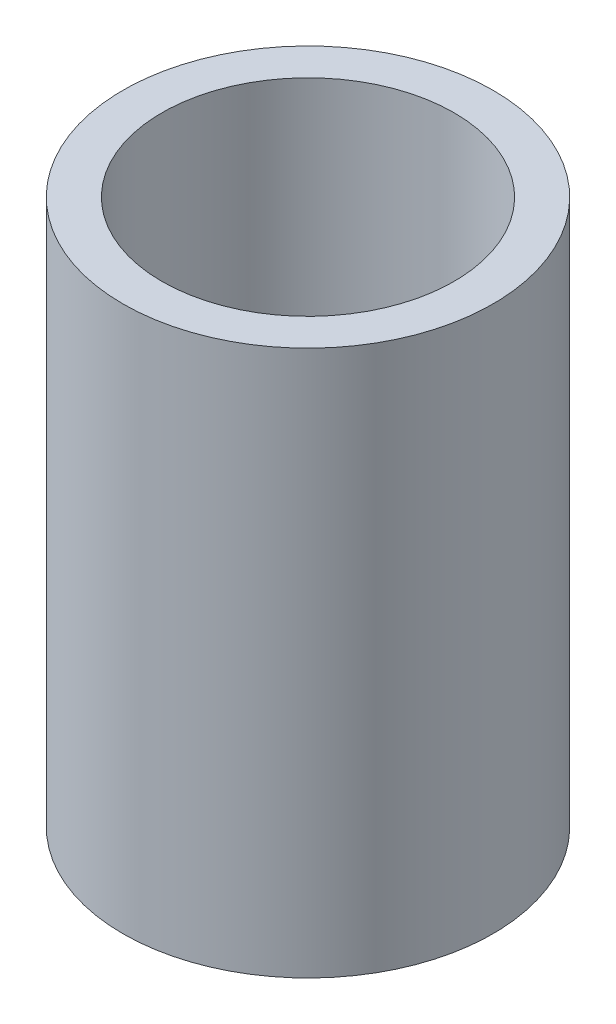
from build123d import *

# Parameters (mm, degrees)
SKETCH3_R          = 30.1625
EXTRUDE1_DEPTH     = 88.9
SKETCH4_R          = 23.8125
CUT_EXTRUDE1_DEPTH = 88.9


with BuildPart() as part:
    # Sketch3 → Extrude1 (new body)
    with BuildSketch(Plane(origin=(0, 0, 0), x_dir=(1, 0, 0), z_dir=(0, 1, 0))):
        with Locations(Location((0, 0, 0), (0, 0, 270))):
            Circle(SKETCH3_R)
    extrude(amount=EXTRUDE1_DEPTH)

    # Sketch4 → Cut-Extrude1 (cut)
    with BuildSketch(Plane.XZ):
        with Locations(Location((0, 0, 0), (0, 0, 270))):
            Circle(SKETCH4_R)
    extrude(amount=-CUT_EXTRUDE1_DEPTH, mode=Mode.SUBTRACT)


solid = part.part
